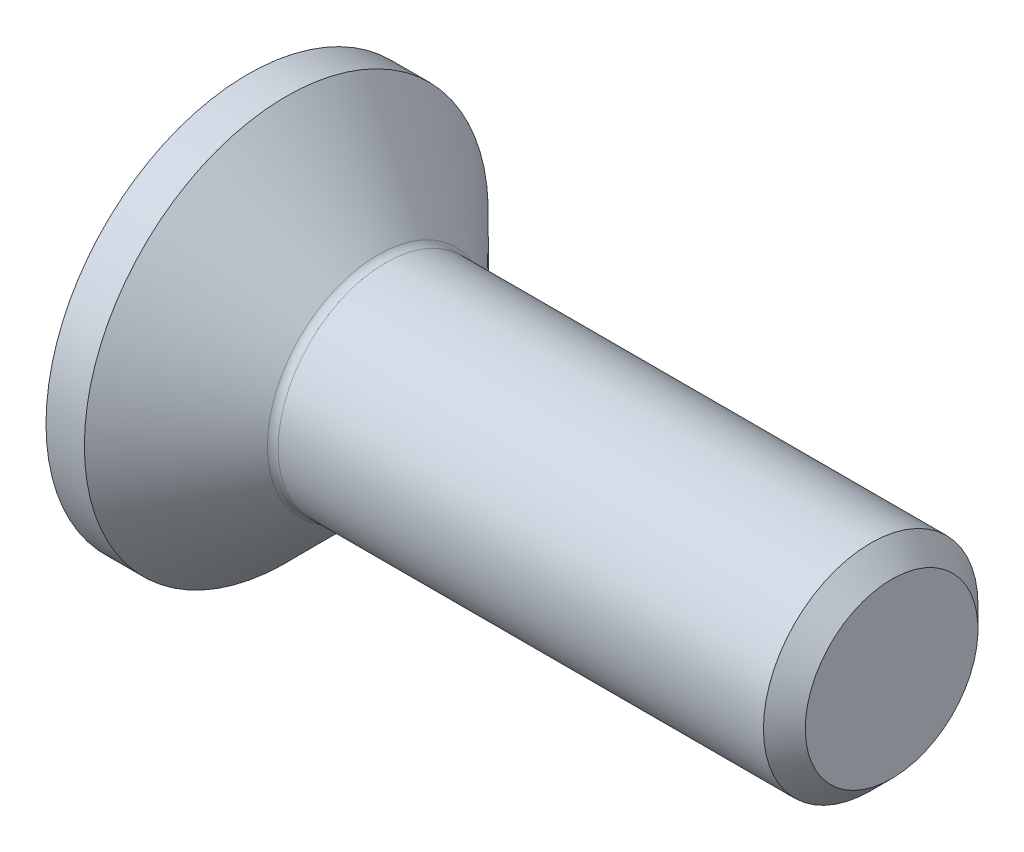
from build123d import *

# Parameters (mm, degrees)
FILLET1_R   = 0.2
HEX_2_DEPTH = 1.5


with BuildPart() as part:
    # BodySke → BaseBody (revolve)
    with BuildSketch(Plane.XY, mode=Mode.PRIVATE) as basebody_sk:
        Polygon((0, 0), (0, 3.765), (0.715, 3.765), (2.48, 2), (11.61, 2), (12, 1.61), (12, 0), align=None)
    revolve(basebody_sk.sketch.rotate(Axis((0, 0, 0), (1, 0, 0)), 90), axis=Axis((0, 0, 0), (1, 0, 0)))

    # Fillet1
    fillet1_edges = [part.edges().sort_by_distance(p)[0] for p in [
        (2.48, 0, -2),
    ]]
    fillet(fillet1_edges, radius=FILLET1_R)

    # Sketch2 → PreBroach (revolve, cut)
    with BuildSketch(Plane.XY, mode=Mode.PRIVATE) as prebroach_sk:
        Polygon((0, 1.25), (1.5, 1.25), (2.221687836, 0), (0, 0), align=None)
    revolve(prebroach_sk.sketch.rotate(Axis((0, 0, 0), (1, 0, 0)), 90), axis=Axis((0, 0, 0), (1, 0, 0)), mode=Mode.SUBTRACT)

    # Sketch3 → Hex 2 (cut)
    with BuildSketch(Plane.ZY):
        Polygon((-1.25, -0.721687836), (-1.25, 0.721687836), (0, 1.443375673), (1.25, 0.721687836), (1.25, -0.721687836), (0, -1.443375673), align=None)
    extrude(amount=-HEX_2_DEPTH, mode=Mode.SUBTRACT)


solid = part.part
